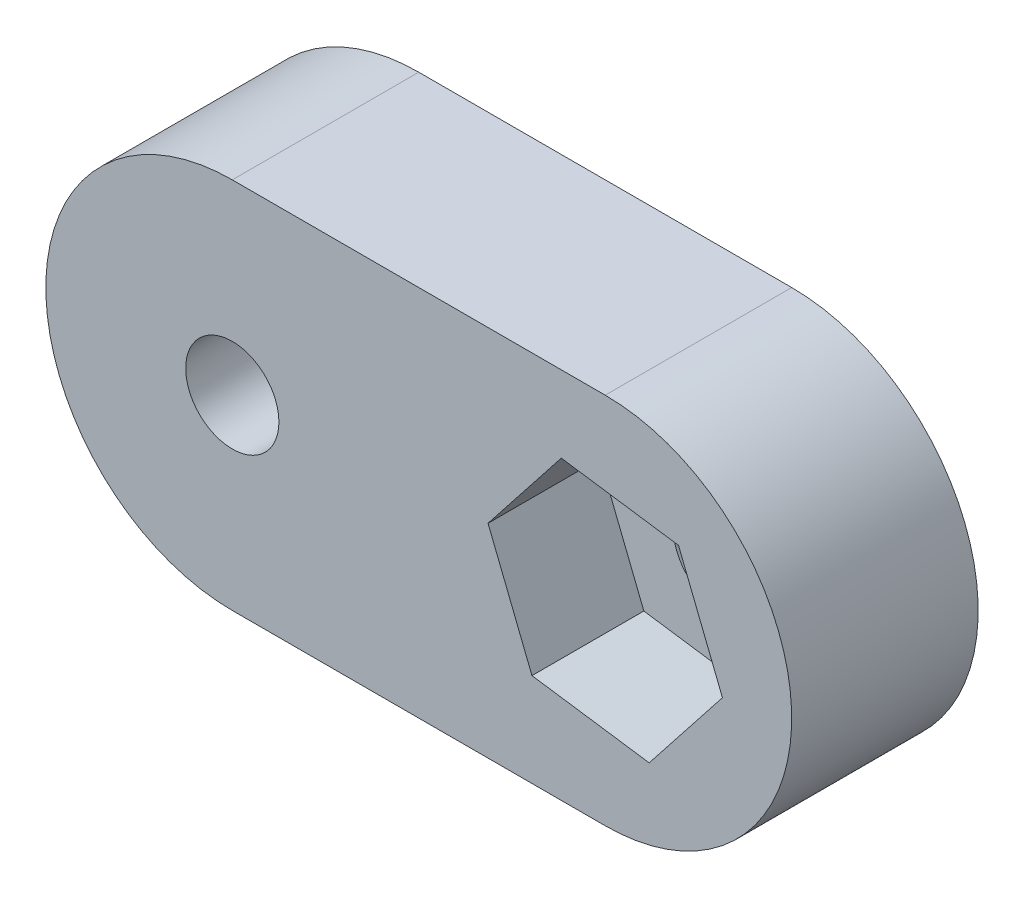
from build123d import *

# Parameters (mm, degrees)
SALIENTE_EXTRUIR1_DEPTH = 5
CROQUIS2_R              = 1.25
SALIENTE_EXTRUIR2_DEPTH = 2
CROQUIS3_R              = 1.25
SALIENTE_EXTRUIR3_DEPTH = 2


with BuildPart() as part:
    # Croquis1 → Saliente-Extruir1 (new body)
    with BuildSketch(Plane.XY):
        with BuildLine():
            Line((0, 5), (10, 5))
            ThreePointArc((10, 5), (15, 0), (10, -5))
            Line((10, -5), (0, -5))
            ThreePointArc((0, -5), (-5, 0), (0, 5))
        make_face()
        Polygon((-1.964486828, 2.4948196), (-3.142820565, -0.453885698), (-1.178333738, -2.948705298), (1.964486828, -2.4948196), (3.142820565, 0.453885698), (1.178333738, 2.948705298), align=None, mode=Mode.SUBTRACT)
        Polygon((13.142820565, -0.453885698), (11.178333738, -2.948705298), (8.035513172, -2.4948196), (6.857179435, 0.453885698), (8.821666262, 2.948705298), (11.964486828, 2.4948196), align=None, mode=Mode.SUBTRACT)
    extrude(amount=SALIENTE_EXTRUIR1_DEPTH)

    # Croquis2 → Saliente-Extruir2 (add)
    with BuildSketch(Plane.XY.offset(5)):
        Polygon((3.142820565, 0.453885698), (1.178333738, 2.948705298), (-1.964486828, 2.4948196), (-3.142820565, -0.453885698), (-1.178333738, -2.948705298), (1.964486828, -2.4948196), align=None)
        Circle(CROQUIS2_R, mode=Mode.SUBTRACT)
    extrude(amount=-SALIENTE_EXTRUIR2_DEPTH)

    # Croquis3 → Saliente-Extruir3 (add)
    with BuildSketch(Plane(origin=(0, 0, 0), x_dir=(-1, 0, 0), z_dir=(0, 0, -1))):
        Polygon((-11.178333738, -2.948705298), (-13.142820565, -0.453885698), (-11.964486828, 2.4948196), (-8.821666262, 2.948705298), (-6.857179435, 0.453885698), (-8.035513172, -2.4948196), align=None)
        with Locations((-10.080340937, -0.201048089)):
            Circle(CROQUIS3_R, mode=Mode.SUBTRACT)
    extrude(amount=-SALIENTE_EXTRUIR3_DEPTH)


solid = part.part
